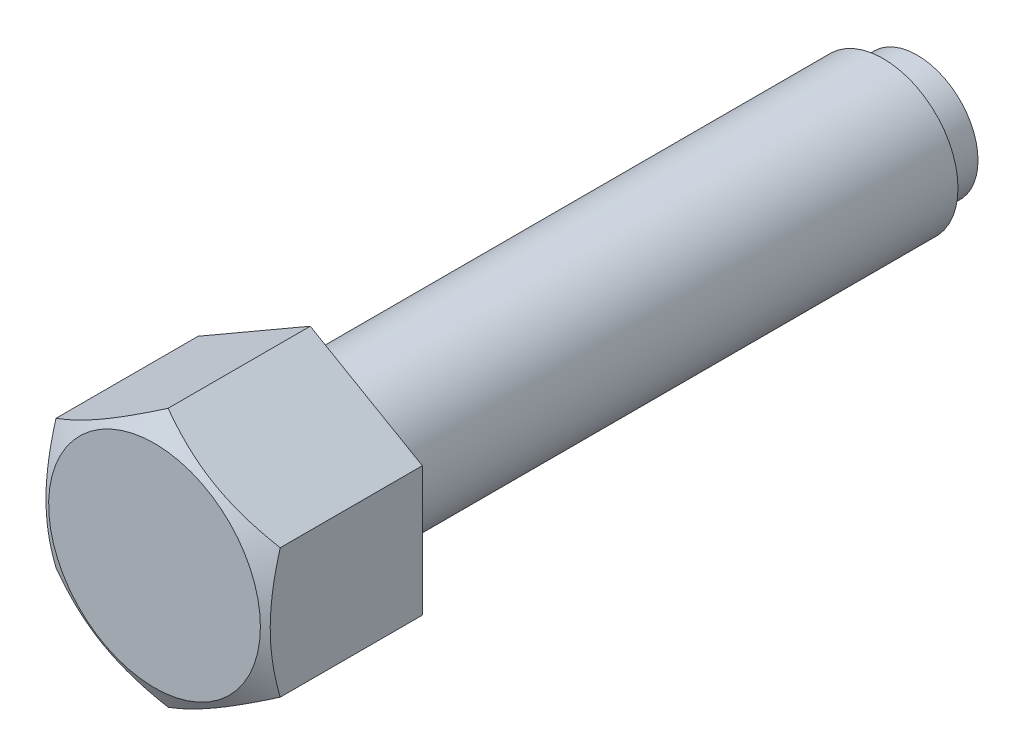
ISO-10303-21;
HEADER;
FILE_DESCRIPTION(('STEP AP214'),'2;1');
FILE_NAME('part.step','',(''),(''),'','','');
FILE_SCHEMA(('AUTOMOTIVE_DESIGN { 1 0 10303 214 1 1 1 1 }'));
ENDSEC;
DATA;
#1=APPLICATION_CONTEXT('core data for automotive mechanical design processes');
#2=APPLICATION_PROTOCOL_DEFINITION('international standard','automotive_design',2000,#1);
#3=PRODUCT_CONTEXT('',#1,'mechanical');
#4=PRODUCT('Part','Part','',(#3));
#5=PRODUCT_RELATED_PRODUCT_CATEGORY('part','',(#4));
#6=PRODUCT_DEFINITION_FORMATION('','',#4);
#7=PRODUCT_DEFINITION_CONTEXT('part definition',#1,'design');
#8=PRODUCT_DEFINITION('design','',#6,#7);
#9=PRODUCT_DEFINITION_SHAPE('','',#8);
#10=(LENGTH_UNIT() NAMED_UNIT(*) SI_UNIT(.MILLI.,.METRE.));
#11=(NAMED_UNIT(*) PLANE_ANGLE_UNIT() SI_UNIT($,.RADIAN.));
#12=(NAMED_UNIT(*) SI_UNIT($,.STERADIAN.) SOLID_ANGLE_UNIT());
#13=UNCERTAINTY_MEASURE_WITH_UNIT(LENGTH_MEASURE(1.E-05),#10,'distance_accuracy_value','');
#14=(GEOMETRIC_REPRESENTATION_CONTEXT(3) GLOBAL_UNCERTAINTY_ASSIGNED_CONTEXT((#13)) GLOBAL_UNIT_ASSIGNED_CONTEXT((#10,
#11,#12)) REPRESENTATION_CONTEXT('',''));
#15=CARTESIAN_POINT('',(0.,0.,0.));
#16=DIRECTION('',(0.,0.,1.));
#17=DIRECTION('',(1.,0.,0.));
#18=AXIS2_PLACEMENT_3D('',#15,#16,#17);
#19=CARTESIAN_POINT('',(0.,20.7846096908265,95.));
#20=DIRECTION('',(-0.5,-0.86602540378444,0.));
#21=DIRECTION('',(0.86602540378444,-0.5,0.));
#22=AXIS2_PLACEMENT_3D('',#19,#20,#21);
#23=PLANE('',#22);
#24=CARTESIAN_POINT('',(18.0002,10.3921893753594,122.814887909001));
#25=CARTESIAN_POINT('',(17.6045674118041,10.6206079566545,122.946756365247));
#26=CARTESIAN_POINT('',(17.2073916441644,10.8499174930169,123.072640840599));
#27=CARTESIAN_POINT('',(16.4098552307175,11.310375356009,123.310778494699));
#28=CARTESIAN_POINT('',(16.0094935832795,11.5415242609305,123.423027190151));
#29=CARTESIAN_POINT('',(15.2048116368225,12.0061075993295,123.632384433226));
#30=CARTESIAN_POINT('',(14.8004842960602,12.2395460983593,123.729457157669));
#31=CARTESIAN_POINT('',(13.9890201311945,12.7080451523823,123.906377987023));
#32=CARTESIAN_POINT('',(13.5818834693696,12.9431056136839,123.98622707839));
#33=CARTESIAN_POINT('',(12.7752328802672,13.4088255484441,124.125304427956));
#34=CARTESIAN_POINT('',(12.3757788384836,13.6394504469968,124.184993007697));
#35=CARTESIAN_POINT('',(11.5750403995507,14.1017570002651,124.285077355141));
#36=CARTESIAN_POINT('',(11.1737559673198,14.3334386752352,124.325472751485));
#37=CARTESIAN_POINT('',(10.370513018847,14.7971912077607,124.385950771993));
#38=CARTESIAN_POINT('',(9.96855587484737,15.0292612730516,124.406057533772));
#39=CARTESIAN_POINT('',(9.16427056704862,15.4936156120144,124.425525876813));
#40=CARTESIAN_POINT('',(8.76194241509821,15.7258998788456,124.424888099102));
#41=CARTESIAN_POINT('',(8.00978065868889,16.1601606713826,124.404316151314));
#42=CARTESIAN_POINT('',(7.65989346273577,16.3621681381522,124.38689054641));
#43=CARTESIAN_POINT('',(6.96095368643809,16.765701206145,124.336680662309));
#44=CARTESIAN_POINT('',(6.61190109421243,16.9672268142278,124.303896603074));
#45=CARTESIAN_POINT('',(5.91476277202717,17.3697198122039,124.223538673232));
#46=CARTESIAN_POINT('',(5.56667820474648,17.5706865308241,124.175951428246));
#47=CARTESIAN_POINT('',(4.87216610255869,17.9716632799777,124.066826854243));
#48=CARTESIAN_POINT('',(4.52573856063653,18.1716733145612,124.005289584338));
#49=CARTESIAN_POINT('',(3.47411308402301,18.7788295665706,123.798187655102));
#50=CARTESIAN_POINT('',(2.77196054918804,19.1842175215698,123.631972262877));
#51=CARTESIAN_POINT('',(1.37812528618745,19.9889486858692,123.254731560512));
#52=CARTESIAN_POINT('',(0.686424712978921,20.3883021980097,123.043794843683));
#53=CARTESIAN_POINT('',(-0.000199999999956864,20.7847251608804,122.814887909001));
#54=B_SPLINE_CURVE_WITH_KNOTS('',3,(#24,#25,#26,#27,#28,#29,#30,#31,#32,#33,#34,#35,#36,#37,#38,
#39,#40,#41,#42,#43,#44,#45,#46,#47,#48,#49,#50,#51,#52,#53),.UNSPECIFIED.,.F.,.F.,(4,2,2,2,2,2,
2,2,2,2,2,2,2,2,4),(0.,1.42650335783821,2.85347447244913,4.28376471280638,5.71397301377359,
7.10888071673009,8.50381526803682,9.89708828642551,11.2903182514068,12.5031974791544,
13.7160593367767,14.9300201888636,16.1439758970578,18.6253607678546,21.1018751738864),.UNSPECIFIED.);
#55=CARTESIAN_POINT('',(18.,10.3923048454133,122.814954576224));
#56=VERTEX_POINT('',#55);
#57=CARTESIAN_POINT('',(0.,20.7846096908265,122.814954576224));
#58=VERTEX_POINT('',#57);
#59=EDGE_CURVE('E30',#56,#58,#54,.T.);
#60=ORIENTED_EDGE('',*,*,#59,.F.);
#61=DIRECTION('',(0.,0.,1.));
#62=VECTOR('',#61,1.);
#63=CARTESIAN_POINT('',(18.,10.3923048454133,95.));
#64=LINE('',#63,#62);
#65=CARTESIAN_POINT('',(18.,10.3923048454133,100.));
#66=VERTEX_POINT('',#65);
#67=EDGE_CURVE('E97',#66,#56,#64,.T.);
#68=ORIENTED_EDGE('',*,*,#67,.F.);
#69=DIRECTION('',(0.86602540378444,-0.5,0.));
#70=VECTOR('',#69,1.);
#71=CARTESIAN_POINT('',(18.,10.3923048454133,100.));
#72=LINE('',#71,#70);
#73=CARTESIAN_POINT('',(0.,20.7846096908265,100.));
#74=VERTEX_POINT('',#73);
#75=EDGE_CURVE('E111',#74,#66,#72,.T.);
#76=ORIENTED_EDGE('',*,*,#75,.F.);
#77=DIRECTION('',(0.,0.,1.));
#78=VECTOR('',#77,1.);
#79=CARTESIAN_POINT('',(0.,20.7846096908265,95.));
#80=LINE('',#79,#78);
#81=EDGE_CURVE('E37',#74,#58,#80,.T.);
#82=ORIENTED_EDGE('',*,*,#81,.T.);
#83=EDGE_LOOP('',(#60,#68,#76,#82));
#84=FACE_BOUND('',#83,.T.);
#85=ADVANCED_FACE('F15',(#84),#23,.F.);
#86=CARTESIAN_POINT('',(18.,10.3923048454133,95.));
#87=DIRECTION('',(-1.,0.,0.));
#88=DIRECTION('',(0.,-1.,0.));
#89=AXIS2_PLACEMENT_3D('',#86,#87,#88);
#90=PLANE('',#89);
#91=CARTESIAN_POINT('',(18.,-27.8488467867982,115.670257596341));
#92=CARTESIAN_POINT('',(18.,-27.4560414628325,115.860718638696));
#93=CARTESIAN_POINT('',(18.,-27.0627733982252,116.050224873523));
#94=CARTESIAN_POINT('',(18.,-26.275215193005,116.42711134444));
#95=CARTESIAN_POINT('',(18.,-25.8809250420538,116.614491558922));
#96=CARTESIAN_POINT('',(18.,-24.6962706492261,117.173168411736));
#97=CARTESIAN_POINT('',(18.,-23.9042396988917,117.540944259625));
#98=CARTESIAN_POINT('',(18.,-22.3105132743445,118.266864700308));
#99=CARTESIAN_POINT('',(18.,-21.5087886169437,118.624945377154));
#100=CARTESIAN_POINT('',(18.,-19.898940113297,119.326369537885));
#101=CARTESIAN_POINT('',(18.,-19.0908165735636,119.669713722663));
#102=CARTESIAN_POINT('',(18.,-17.4410835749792,120.348376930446));
#103=CARTESIAN_POINT('',(18.,-16.5992255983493,120.68309500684));
#104=CARTESIAN_POINT('',(18.,-14.9056301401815,121.327039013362));
#105=CARTESIAN_POINT('',(18.,-14.0538915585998,121.636262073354));
#106=CARTESIAN_POINT('',(18.,-12.3408234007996,122.221045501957));
#107=CARTESIAN_POINT('',(18.,-11.4795174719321,122.496674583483));
#108=CARTESIAN_POINT('',(18.,-9.74446925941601,123.005397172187));
#109=CARTESIAN_POINT('',(18.,-8.87073100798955,123.238504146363));
#110=CARTESIAN_POINT('',(18.,-7.55305733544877,123.547171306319));
#111=CARTESIAN_POINT('',(18.,-7.11384633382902,123.643024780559));
#112=CARTESIAN_POINT('',(18.,-6.23243569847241,123.819917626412));
#113=CARTESIAN_POINT('',(18.,-5.79023612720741,123.900957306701));
#114=CARTESIAN_POINT('',(18.,-4.90316617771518,124.046786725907));
#115=CARTESIAN_POINT('',(18.,-4.45829588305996,124.111576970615));
#116=CARTESIAN_POINT('',(18.,-3.56633655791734,124.22361667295));
#117=CARTESIAN_POINT('',(18.,-3.11924752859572,124.270866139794));
#118=CARTESIAN_POINT('',(18.,-2.2293097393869,124.346292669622));
#119=CARTESIAN_POINT('',(18.,-1.78648144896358,124.374709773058));
#120=CARTESIAN_POINT('',(18.,-0.900021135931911,124.412796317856));
#121=CARTESIAN_POINT('',(18.,-0.456389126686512,124.422466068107));
#122=CARTESIAN_POINT('',(18.,0.430888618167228,124.422828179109));
#123=CARTESIAN_POINT('',(18.,0.874534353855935,124.413520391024));
#124=CARTESIAN_POINT('',(18.,1.76103997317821,124.37615322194));
#125=CARTESIAN_POINT('',(18.,2.20389982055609,124.348092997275));
#126=CARTESIAN_POINT('',(18.,3.27021347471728,124.258545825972));
#127=CARTESIAN_POINT('',(18.,3.89292400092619,124.188051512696));
#128=CARTESIAN_POINT('',(18.,5.13368373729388,124.013841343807));
#129=CARTESIAN_POINT('',(18.,5.75173229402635,123.910120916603));
#130=CARTESIAN_POINT('',(18.,6.98259150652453,123.673148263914));
#131=CARTESIAN_POINT('',(18.,7.59539765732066,123.539872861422));
#132=CARTESIAN_POINT('',(18.,8.81484353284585,123.247852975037));
#133=CARTESIAN_POINT('',(18.,9.42148335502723,123.089108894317));
#134=CARTESIAN_POINT('',(18.,10.6419538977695,122.746253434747));
#135=CARTESIAN_POINT('',(18.,11.2556482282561,122.561659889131));
#136=CARTESIAN_POINT('',(18.,12.4769902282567,122.173550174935));
#137=CARTESIAN_POINT('',(18.,13.0846378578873,121.970033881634));
#138=CARTESIAN_POINT('',(18.,14.2941900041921,121.547297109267));
#139=CARTESIAN_POINT('',(18.,14.8960963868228,121.32808194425));
#140=CARTESIAN_POINT('',(18.,16.0949308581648,120.876511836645));
#141=CARTESIAN_POINT('',(18.,16.6918590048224,120.644157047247));
#142=CARTESIAN_POINT('',(18.,18.0994905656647,120.081236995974));
#143=CARTESIAN_POINT('',(18.,18.9082876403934,119.74591194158));
#144=CARTESIAN_POINT('',(18.,20.5190326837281,119.059150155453));
#145=CARTESIAN_POINT('',(18.,21.3209802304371,118.707712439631));
#146=CARTESIAN_POINT('',(18.,22.919303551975,117.991953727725));
#147=CARTESIAN_POINT('',(18.,23.7156780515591,117.627629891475));
#148=CARTESIAN_POINT('',(18.,25.3036095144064,116.888699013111));
#149=CARTESIAN_POINT('',(18.,26.0951665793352,116.514092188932));
#150=CARTESIAN_POINT('',(18.,27.6751211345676,115.75610675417));
#151=CARTESIAN_POINT('',(18.,28.4635142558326,115.372719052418));
#152=CARTESIAN_POINT('',(18.,30.0369178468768,114.599065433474));
#153=CARTESIAN_POINT('',(18.,30.82192830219,114.208799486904));
#154=CARTESIAN_POINT('',(18.,32.3889887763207,113.422617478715));
#155=CARTESIAN_POINT('',(18.,33.1710391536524,113.026702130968));
#156=CARTESIAN_POINT('',(18.,34.7327014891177,112.230099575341));
#157=CARTESIAN_POINT('',(18.,35.5123134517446,111.829412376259));
#158=CARTESIAN_POINT('',(18.,37.7175837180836,110.688807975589));
#159=CARTESIAN_POINT('',(18.,39.1407964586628,109.944162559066));
#160=CARTESIAN_POINT('',(18.,41.9819614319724,108.444806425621));
#161=CARTESIAN_POINT('',(18.,43.3999134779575,107.690095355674));
#162=CARTESIAN_POINT('',(18.,46.2281945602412,106.174837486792));
#163=CARTESIAN_POINT('',(18.,47.6385337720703,105.41430966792));
#164=CARTESIAN_POINT('',(18.,49.7515613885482,104.269036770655));
#165=CARTESIAN_POINT('',(18.,50.4554715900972,103.886542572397));
#166=CARTESIAN_POINT('',(18.,51.8625585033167,103.120209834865));
#167=CARTESIAN_POINT('',(18.,52.5657352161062,102.736371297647));
#168=CARTESIAN_POINT('',(18.,53.268586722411,102.351938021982));
#169=B_SPLINE_CURVE_WITH_KNOTS('',3,(#91,#92,#93,#94,#95,#96,#97,#98,#99,#100,#101,#102,#103,
#104,#105,#106,#107,#108,#109,#110,#111,#112,#113,#114,#115,#116,#117,#118,#119,#120,#121,#122,
#123,#124,#125,#126,#127,#128,#129,#130,#131,#132,#133,#134,#135,#136,#137,#138,#139,#140,#141,
#142,#143,#144,#145,#146,#147,#148,#149,#150,#151,#152,#153,#154,#155,#156,#157,#158,#159,#160,
#161,#162,#163,#164,#165,#166,#167,#168),.UNSPECIFIED.,.F.,.F.,(4,2,2,2,2,2,2,2,2,2,2,2,2,2,2,2,
2,2,2,2,2,2,2,2,2,2,2,2,2,2,2,2,2,2,2,2,2,2,4),(0.,1.30963224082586,2.61927778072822,
5.23895990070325,7.87301555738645,10.5069457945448,13.2245064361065,15.9423725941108,
18.654582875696,21.3659326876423,22.714369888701,24.0627789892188,25.4111461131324,
26.759512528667,28.0903438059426,29.4211531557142,30.7519729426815,32.0828526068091,
33.9618754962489,35.8411570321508,37.7219175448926,39.6026482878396,41.5248491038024,
43.447062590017,45.368628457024,47.2901719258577,49.9165980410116,52.5431847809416,
55.1703540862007,57.7974677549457,60.427436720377,63.0574169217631,65.6870676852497,
68.3167136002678,73.1353953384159,77.9542465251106,82.7612146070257,85.1645700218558,
87.5679217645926),.UNSPECIFIED.);
#170=CARTESIAN_POINT('',(18.,-10.3923048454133,122.814954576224));
#171=VERTEX_POINT('',#170);
#172=EDGE_CURVE('E157',#171,#56,#169,.T.);
#173=ORIENTED_EDGE('',*,*,#172,.F.);
#174=DIRECTION('',(0.,0.,1.));
#175=VECTOR('',#174,1.);
#176=CARTESIAN_POINT('',(18.,-10.3923048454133,95.));
#177=LINE('',#176,#175);
#178=CARTESIAN_POINT('',(18.,-10.3923048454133,100.));
#179=VERTEX_POINT('',#178);
#180=EDGE_CURVE('E94',#179,#171,#177,.T.);
#181=ORIENTED_EDGE('',*,*,#180,.F.);
#182=DIRECTION('',(0.,-1.,0.));
#183=VECTOR('',#182,1.);
#184=CARTESIAN_POINT('',(18.,0.,100.));
#185=LINE('',#184,#183);
#186=EDGE_CURVE('E108',#66,#179,#185,.T.);
#187=ORIENTED_EDGE('',*,*,#186,.F.);
#188=ORIENTED_EDGE('',*,*,#67,.T.);
#189=EDGE_LOOP('',(#173,#181,#187,#188));
#190=FACE_BOUND('',#189,.T.);
#191=ADVANCED_FACE('F137',(#190),#90,.F.);
#192=CARTESIAN_POINT('',(0.,-20.7846096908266,95.));
#193=DIRECTION('',(0.5,-0.866025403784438,0.));
#194=DIRECTION('',(0.866025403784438,0.5,0.));
#195=AXIS2_PLACEMENT_3D('',#192,#193,#194);
#196=PLANE('',#195);
#197=ORIENTED_EDGE('',*,*,#180,.T.);
#198=CARTESIAN_POINT('',(18.0002,-10.3921893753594,122.814887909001));
#199=CARTESIAN_POINT('',(17.6045674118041,-10.6206079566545,122.946756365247));
#200=CARTESIAN_POINT('',(17.2073916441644,-10.8499174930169,123.072640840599));
#201=CARTESIAN_POINT('',(16.4098552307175,-11.310375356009,123.310778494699));
#202=CARTESIAN_POINT('',(16.0094935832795,-11.5415242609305,123.423027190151));
#203=CARTESIAN_POINT('',(15.2048116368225,-12.0061075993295,123.632384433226));
#204=CARTESIAN_POINT('',(14.8004842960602,-12.2395460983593,123.729457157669));
#205=CARTESIAN_POINT('',(13.9890201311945,-12.7080451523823,123.906377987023));
#206=CARTESIAN_POINT('',(13.5818834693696,-12.9431056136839,123.98622707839));
#207=CARTESIAN_POINT('',(12.7752328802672,-13.4088255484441,124.125304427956));
#208=CARTESIAN_POINT('',(12.3757788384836,-13.6394504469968,124.184993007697));
#209=CARTESIAN_POINT('',(11.5750403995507,-14.1017570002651,124.285077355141));
#210=CARTESIAN_POINT('',(11.1737559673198,-14.3334386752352,124.325472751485));
#211=CARTESIAN_POINT('',(10.370513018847,-14.7971912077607,124.385950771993));
#212=CARTESIAN_POINT('',(9.96855587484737,-15.0292612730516,124.406057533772));
#213=CARTESIAN_POINT('',(9.16427056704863,-15.4936156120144,124.425525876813));
#214=CARTESIAN_POINT('',(8.76194241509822,-15.7258998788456,124.424888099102));
#215=CARTESIAN_POINT('',(8.0097806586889,-16.1601606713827,124.404316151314));
#216=CARTESIAN_POINT('',(7.65989346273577,-16.3621681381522,124.38689054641));
#217=CARTESIAN_POINT('',(6.96095368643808,-16.765701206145,124.336680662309));
#218=CARTESIAN_POINT('',(6.61190109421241,-16.9672268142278,124.303896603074));
#219=CARTESIAN_POINT('',(5.91476277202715,-17.3697198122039,124.223538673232));
#220=CARTESIAN_POINT('',(5.56667820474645,-17.5706865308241,124.175951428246));
#221=CARTESIAN_POINT('',(4.87216610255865,-17.9716632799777,124.066826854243));
#222=CARTESIAN_POINT('',(4.52573856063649,-18.1716733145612,124.005289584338));
#223=CARTESIAN_POINT('',(3.47411308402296,-18.7788295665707,123.798187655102));
#224=CARTESIAN_POINT('',(2.77196054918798,-19.1842175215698,123.631972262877));
#225=CARTESIAN_POINT('',(1.37812528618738,-19.9889486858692,123.254731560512));
#226=CARTESIAN_POINT('',(0.686424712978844,-20.3883021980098,123.043794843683));
#227=CARTESIAN_POINT('',(-0.000200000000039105,-20.7847251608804,122.814887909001));
#228=B_SPLINE_CURVE_WITH_KNOTS('',3,(#198,#199,#200,#201,#202,#203,#204,#205,#206,#207,#208,
#209,#210,#211,#212,#213,#214,#215,#216,#217,#218,#219,#220,#221,#222,#223,#224,#225,#226,#227),
.UNSPECIFIED.,.F.,.F.,(4,2,2,2,2,2,2,2,2,2,2,2,2,2,4),(0.,1.42650335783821,2.85347447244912,
4.28376471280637,5.71397301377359,7.10888071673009,8.50381526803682,9.89708828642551,
11.2903182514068,12.5031974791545,13.7160593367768,14.9300201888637,16.1439758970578,
18.6253607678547,21.1018751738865),.UNSPECIFIED.);
#229=CARTESIAN_POINT('',(0.,-20.7846096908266,122.814954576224));
#230=VERTEX_POINT('',#229);
#231=EDGE_CURVE('E163',#171,#230,#228,.T.);
#232=ORIENTED_EDGE('',*,*,#231,.T.);
#233=DIRECTION('',(0.,0.,1.));
#234=VECTOR('',#233,1.);
#235=CARTESIAN_POINT('',(0.,-20.7846096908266,95.));
#236=LINE('',#235,#234);
#237=CARTESIAN_POINT('',(0.,-20.7846096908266,100.));
#238=VERTEX_POINT('',#237);
#239=EDGE_CURVE('E87',#238,#230,#236,.T.);
#240=ORIENTED_EDGE('',*,*,#239,.F.);
#241=DIRECTION('',(0.866025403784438,0.5,0.));
#242=VECTOR('',#241,1.);
#243=CARTESIAN_POINT('',(18.,-10.3923048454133,100.));
#244=LINE('',#243,#242);
#245=EDGE_CURVE('E106',#238,#179,#244,.T.);
#246=ORIENTED_EDGE('',*,*,#245,.T.);
#247=EDGE_LOOP('',(#197,#232,#240,#246));
#248=FACE_BOUND('',#247,.T.);
#249=ADVANCED_FACE('F143',(#248),#196,.T.);
#250=CARTESIAN_POINT('',(0.,-20.7846096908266,95.));
#251=DIRECTION('',(0.5,0.866025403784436,0.));
#252=DIRECTION('',(-0.866025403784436,0.5,0.));
#253=AXIS2_PLACEMENT_3D('',#250,#251,#252);
#254=PLANE('',#253);
#255=CARTESIAN_POINT('',(-18.0002,-10.3921893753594,122.814887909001));
#256=CARTESIAN_POINT('',(-17.6045674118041,-10.6206079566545,122.946756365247));
#257=CARTESIAN_POINT('',(-17.2073916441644,-10.8499174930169,123.072640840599));
#258=CARTESIAN_POINT('',(-16.4098552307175,-11.310375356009,123.310778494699));
#259=CARTESIAN_POINT('',(-16.0094935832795,-11.5415242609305,123.423027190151));
#260=CARTESIAN_POINT('',(-15.2048116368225,-12.0061075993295,123.632384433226));
#261=CARTESIAN_POINT('',(-14.8004842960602,-12.2395460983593,123.729457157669));
#262=CARTESIAN_POINT('',(-13.9890201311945,-12.7080451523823,123.906377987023));
#263=CARTESIAN_POINT('',(-13.5818834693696,-12.9431056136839,123.98622707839));
#264=CARTESIAN_POINT('',(-12.7752328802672,-13.4088255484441,124.125304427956));
#265=CARTESIAN_POINT('',(-12.3757788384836,-13.6394504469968,124.184993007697));
#266=CARTESIAN_POINT('',(-11.5750403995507,-14.1017570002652,124.285077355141));
#267=CARTESIAN_POINT('',(-11.1737559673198,-14.3334386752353,124.325472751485));
#268=CARTESIAN_POINT('',(-10.3705130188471,-14.7971912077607,124.385950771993));
#269=CARTESIAN_POINT('',(-9.96855587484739,-15.0292612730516,124.406057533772));
#270=CARTESIAN_POINT('',(-9.16427056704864,-15.4936156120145,124.425525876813));
#271=CARTESIAN_POINT('',(-8.76194241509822,-15.7258998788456,124.424888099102));
#272=CARTESIAN_POINT('',(-8.0097806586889,-16.1601606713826,124.404316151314));
#273=CARTESIAN_POINT('',(-7.65989346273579,-16.3621681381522,124.38689054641));
#274=CARTESIAN_POINT('',(-6.96095368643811,-16.765701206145,124.336680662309));
#275=CARTESIAN_POINT('',(-6.61190109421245,-16.9672268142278,124.303896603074));
#276=CARTESIAN_POINT('',(-5.91476277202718,-17.3697198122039,124.223538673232));
#277=CARTESIAN_POINT('',(-5.56667820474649,-17.5706865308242,124.175951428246));
#278=CARTESIAN_POINT('',(-4.8721661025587,-17.9716632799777,124.066826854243));
#279=CARTESIAN_POINT('',(-4.52573856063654,-18.1716733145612,124.005289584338));
#280=CARTESIAN_POINT('',(-3.47411308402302,-18.7788295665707,123.798187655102));
#281=CARTESIAN_POINT('',(-2.77196054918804,-19.1842175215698,123.631972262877));
#282=CARTESIAN_POINT('',(-1.37812528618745,-19.9889486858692,123.254731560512));
#283=CARTESIAN_POINT('',(-0.686424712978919,-20.3883021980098,123.043794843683));
#284=CARTESIAN_POINT('',(0.000199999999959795,-20.7847251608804,122.814887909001));
#285=B_SPLINE_CURVE_WITH_KNOTS('',3,(#255,#256,#257,#258,#259,#260,#261,#262,#263,#264,#265,
#266,#267,#268,#269,#270,#271,#272,#273,#274,#275,#276,#277,#278,#279,#280,#281,#282,#283,#284),
.UNSPECIFIED.,.F.,.F.,(4,2,2,2,2,2,2,2,2,2,2,2,2,2,4),(0.,1.42650335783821,2.85347447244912,
4.28376471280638,5.71397301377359,7.10888071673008,8.50381526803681,9.8970882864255,
11.2903182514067,12.5031974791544,13.7160593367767,14.9300201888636,16.1439758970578,
18.6253607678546,21.1018751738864),.UNSPECIFIED.);
#286=CARTESIAN_POINT('',(-18.,-10.3923048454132,122.814954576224));
#287=VERTEX_POINT('',#286);
#288=EDGE_CURVE('E81',#287,#230,#285,.T.);
#289=ORIENTED_EDGE('',*,*,#288,.F.);
#290=DIRECTION('',(0.,0.,1.));
#291=VECTOR('',#290,1.);
#292=CARTESIAN_POINT('',(-18.,-10.3923048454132,95.));
#293=LINE('',#292,#291);
#294=CARTESIAN_POINT('',(-18.,-10.3923048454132,100.));
#295=VERTEX_POINT('',#294);
#296=EDGE_CURVE('E80',#295,#287,#293,.T.);
#297=ORIENTED_EDGE('',*,*,#296,.F.);
#298=DIRECTION('',(-0.866025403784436,0.5,0.));
#299=VECTOR('',#298,1.);
#300=CARTESIAN_POINT('',(-1.3010426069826E-13,-20.7846096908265,100.));
#301=LINE('',#300,#299);
#302=EDGE_CURVE('E103',#238,#295,#301,.T.);
#303=ORIENTED_EDGE('',*,*,#302,.F.);
#304=ORIENTED_EDGE('',*,*,#239,.T.);
#305=EDGE_LOOP('',(#289,#297,#303,#304));
#306=FACE_BOUND('',#305,.T.);
#307=ADVANCED_FACE('F239',(#306),#254,.F.);
#308=CARTESIAN_POINT('',(-18.,10.3923048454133,95.));
#309=DIRECTION('',(-1.,0.,0.));
#310=DIRECTION('',(0.,0.,1.));
#311=AXIS2_PLACEMENT_3D('',#308,#309,#310);
#312=PLANE('',#311);
#313=ORIENTED_EDGE('',*,*,#296,.T.);
#314=CARTESIAN_POINT('',(-18.,-27.848846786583,115.670257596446));
#315=CARTESIAN_POINT('',(-18.,-27.4560414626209,115.860718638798));
#316=CARTESIAN_POINT('',(-18.,-27.0627733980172,116.050224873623));
#317=CARTESIAN_POINT('',(-18.,-26.2752151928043,116.427111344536));
#318=CARTESIAN_POINT('',(-18.,-25.8809250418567,116.614491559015));
#319=CARTESIAN_POINT('',(-18.,-24.6962706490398,117.173168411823));
#320=CARTESIAN_POINT('',(-18.,-23.9042396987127,117.540944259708));
#321=CARTESIAN_POINT('',(-18.,-22.3105132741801,118.266864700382));
#322=CARTESIAN_POINT('',(-18.,-21.5087886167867,118.624945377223));
#323=CARTESIAN_POINT('',(-18.,-19.8989401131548,119.326369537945));
#324=CARTESIAN_POINT('',(-18.,-19.0908165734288,119.66971372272));
#325=CARTESIAN_POINT('',(-18.,-17.4410835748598,120.348376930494));
#326=CARTESIAN_POINT('',(-18.,-16.5992255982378,120.683095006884));
#327=CARTESIAN_POINT('',(-18.,-14.9056301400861,121.327039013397));
#328=CARTESIAN_POINT('',(-18.,-14.0538915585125,121.636262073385));
#329=CARTESIAN_POINT('',(-18.,-12.3408234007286,122.22104550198));
#330=CARTESIAN_POINT('',(-18.,-11.4795174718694,122.496674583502));
#331=CARTESIAN_POINT('',(-18.,-9.74446925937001,123.0053971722));
#332=CARTESIAN_POINT('',(-18.,-8.87073100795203,123.238504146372));
#333=CARTESIAN_POINT('',(-18.,-7.55305733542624,123.547171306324));
#334=CARTESIAN_POINT('',(-18.,-7.11384633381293,123.643024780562));
#335=CARTESIAN_POINT('',(-18.,-6.2324356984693,123.819917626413));
#336=CARTESIAN_POINT('',(-18.,-5.79023612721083,123.9009573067));
#337=CARTESIAN_POINT('',(-18.,-4.90316617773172,124.046786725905));
#338=CARTESIAN_POINT('',(-18.,-4.45829588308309,124.111576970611));
#339=CARTESIAN_POINT('',(-18.,-3.56633655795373,124.223616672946));
#340=CARTESIAN_POINT('',(-18.,-3.11924752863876,124.27086613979));
#341=CARTESIAN_POINT('',(-18.,-2.22930973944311,124.346292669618));
#342=CARTESIAN_POINT('',(-18.,-1.78648144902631,124.374709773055));
#343=CARTESIAN_POINT('',(-18.,-0.900021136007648,124.412796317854));
#344=CARTESIAN_POINT('',(-18.,-0.456389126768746,124.422466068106));
#345=CARTESIAN_POINT('',(-18.,0.430888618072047,124.42282817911));
#346=CARTESIAN_POINT('',(-18.,0.874534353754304,124.413520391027));
#347=CARTESIAN_POINT('',(-18.,1.76103997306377,124.376153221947));
#348=CARTESIAN_POINT('',(-18.,2.20389982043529,124.348092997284));
#349=CARTESIAN_POINT('',(-18.,3.2702134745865,124.258545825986));
#350=CARTESIAN_POINT('',(-18.,3.8929240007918,124.188051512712));
#351=CARTESIAN_POINT('',(-18.,5.13368373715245,124.01384134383));
#352=CARTESIAN_POINT('',(-18.,5.75173229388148,123.910120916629));
#353=CARTESIAN_POINT('',(-18.,6.98259150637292,123.673148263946));
#354=CARTESIAN_POINT('',(-18.,7.59539765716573,123.539872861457));
#355=CARTESIAN_POINT('',(-18.,8.81484353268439,123.247852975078));
#356=CARTESIAN_POINT('',(-18.,9.42148335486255,123.089108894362));
#357=CARTESIAN_POINT('',(-18.,10.6419538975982,122.746253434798));
#358=CARTESIAN_POINT('',(-18.,11.2556482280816,122.561659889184));
#359=CARTESIAN_POINT('',(-18.,12.4769902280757,122.173550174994));
#360=CARTESIAN_POINT('',(-18.,13.084637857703,121.970033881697));
#361=CARTESIAN_POINT('',(-18.,14.2941900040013,121.547297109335));
#362=CARTESIAN_POINT('',(-18.,14.8960963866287,121.328081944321));
#363=CARTESIAN_POINT('',(-18.,16.0949308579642,120.876511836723));
#364=CARTESIAN_POINT('',(-18.,16.6918590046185,120.644157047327));
#365=CARTESIAN_POINT('',(-18.,18.0994905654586,120.081236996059));
#366=CARTESIAN_POINT('',(-18.,18.9082876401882,119.745911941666));
#367=CARTESIAN_POINT('',(-18.,20.5190326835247,119.059150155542));
#368=CARTESIAN_POINT('',(-18.,21.3209802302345,118.707712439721));
#369=CARTESIAN_POINT('',(-18.,22.919303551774,117.991953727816));
#370=CARTESIAN_POINT('',(-18.,23.7156780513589,117.627629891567));
#371=CARTESIAN_POINT('',(-18.,25.3036095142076,116.888699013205));
#372=CARTESIAN_POINT('',(-18.,26.0951665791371,116.514092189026));
#373=CARTESIAN_POINT('',(-18.,27.6751211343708,115.756106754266));
#374=CARTESIAN_POINT('',(-18.,28.4635142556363,115.372719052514));
#375=CARTESIAN_POINT('',(-18.,30.0369178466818,114.599065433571));
#376=CARTESIAN_POINT('',(-18.,30.8219283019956,114.208799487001));
#377=CARTESIAN_POINT('',(-18.,32.3889887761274,113.422617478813));
#378=CARTESIAN_POINT('',(-18.,33.1710391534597,113.026702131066));
#379=CARTESIAN_POINT('',(-18.,34.732701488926,112.230099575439));
#380=CARTESIAN_POINT('',(-18.,35.5123134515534,111.829412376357));
#381=CARTESIAN_POINT('',(-18.,37.7175837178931,110.688807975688));
#382=CARTESIAN_POINT('',(-18.,39.1407964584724,109.944162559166));
#383=CARTESIAN_POINT('',(-18.,41.9819614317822,108.444806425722));
#384=CARTESIAN_POINT('',(-18.,43.3999134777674,107.690095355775));
#385=CARTESIAN_POINT('',(-18.,46.2281945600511,106.174837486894));
#386=CARTESIAN_POINT('',(-18.,47.6385337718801,105.414309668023));
#387=CARTESIAN_POINT('',(-18.,49.7515613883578,104.269036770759));
#388=CARTESIAN_POINT('',(-18.,50.4554715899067,103.8865425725));
#389=CARTESIAN_POINT('',(-18.,51.8625585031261,103.120209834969));
#390=CARTESIAN_POINT('',(-18.,52.5657352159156,102.736371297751));
#391=CARTESIAN_POINT('',(-18.,53.2685867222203,102.351938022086));
#392=B_SPLINE_CURVE_WITH_KNOTS('',3,(#314,#315,#316,#317,#318,#319,#320,#321,#322,#323,#324,
#325,#326,#327,#328,#329,#330,#331,#332,#333,#334,#335,#336,#337,#338,#339,#340,#341,#342,#343,
#344,#345,#346,#347,#348,#349,#350,#351,#352,#353,#354,#355,#356,#357,#358,#359,#360,#361,#362,
#363,#364,#365,#366,#367,#368,#369,#370,#371,#372,#373,#374,#375,#376,#377,#378,#379,#380,#381,
#382,#383,#384,#385,#386,#387,#388,#389,#390,#391),.UNSPECIFIED.,.F.,.F.,(4,2,2,2,2,2,2,2,2,2,2,
2,2,2,2,2,2,2,2,2,2,2,2,2,2,2,2,2,2,2,2,2,2,2,2,2,2,2,4),(0.,1.30963224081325,2.61927778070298,
5.23895990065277,7.87301555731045,10.5069457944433,13.224506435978,15.9423725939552,
18.6545828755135,21.3659326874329,22.7143698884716,24.0627789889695,25.4111461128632,
26.759512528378,28.0903438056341,29.4211531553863,30.7519729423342,32.0828526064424,
33.9618754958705,35.8411570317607,37.7219175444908,39.6026482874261,41.5248491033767,
43.4470625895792,45.368628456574,47.2901719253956,49.9165980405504,52.5431847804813,
55.1703540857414,57.7974677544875,60.4274367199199,63.0574169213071,65.6870676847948,
68.316713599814,73.1353953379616,77.9542465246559,82.7612146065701,85.1645700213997,
87.567921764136),.UNSPECIFIED.);
#393=CARTESIAN_POINT('',(-18.,10.3923048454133,122.814954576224));
#394=VERTEX_POINT('',#393);
#395=EDGE_CURVE('E68',#287,#394,#392,.T.);
#396=ORIENTED_EDGE('',*,*,#395,.T.);
#397=DIRECTION('',(0.,0.,1.));
#398=VECTOR('',#397,1.);
#399=CARTESIAN_POINT('',(-18.,10.3923048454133,95.));
#400=LINE('',#399,#398);
#401=CARTESIAN_POINT('',(-18.,10.3923048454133,100.));
#402=VERTEX_POINT('',#401);
#403=EDGE_CURVE('E77',#402,#394,#400,.T.);
#404=ORIENTED_EDGE('',*,*,#403,.F.);
#405=DIRECTION('',(0.,-1.,0.));
#406=VECTOR('',#405,1.);
#407=CARTESIAN_POINT('',(-18.,0.,100.));
#408=LINE('',#407,#406);
#409=EDGE_CURVE('E101',#402,#295,#408,.T.);
#410=ORIENTED_EDGE('',*,*,#409,.T.);
#411=EDGE_LOOP('',(#313,#396,#404,#410));
#412=FACE_BOUND('',#411,.T.);
#413=ADVANCED_FACE('F76',(#412),#312,.T.);
#414=CARTESIAN_POINT('',(0.,20.7846096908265,95.));
#415=DIRECTION('',(-0.5,0.866025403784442,0.));
#416=DIRECTION('',(-0.866025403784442,-0.5,0.));
#417=AXIS2_PLACEMENT_3D('',#414,#415,#416);
#418=PLANE('',#417);
#419=ORIENTED_EDGE('',*,*,#403,.T.);
#420=CARTESIAN_POINT('',(-18.0002,10.3921893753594,122.814887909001));
#421=CARTESIAN_POINT('',(-17.6045674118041,10.6206079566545,122.946756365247));
#422=CARTESIAN_POINT('',(-17.2073916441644,10.8499174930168,123.072640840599));
#423=CARTESIAN_POINT('',(-16.4098552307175,11.310375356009,123.310778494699));
#424=CARTESIAN_POINT('',(-16.0094935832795,11.5415242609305,123.423027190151));
#425=CARTESIAN_POINT('',(-15.2048116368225,12.0061075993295,123.632384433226));
#426=CARTESIAN_POINT('',(-14.8004842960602,12.2395460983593,123.729457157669));
#427=CARTESIAN_POINT('',(-13.9890201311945,12.7080451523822,123.906377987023));
#428=CARTESIAN_POINT('',(-13.5818834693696,12.9431056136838,123.98622707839));
#429=CARTESIAN_POINT('',(-12.7752328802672,13.4088255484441,124.125304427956));
#430=CARTESIAN_POINT('',(-12.3757788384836,13.6394504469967,124.184993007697));
#431=CARTESIAN_POINT('',(-11.5750403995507,14.1017570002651,124.285077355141));
#432=CARTESIAN_POINT('',(-11.1737559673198,14.3334386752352,124.325472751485));
#433=CARTESIAN_POINT('',(-10.370513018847,14.7971912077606,124.385950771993));
#434=CARTESIAN_POINT('',(-9.96855587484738,15.0292612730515,124.406057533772));
#435=CARTESIAN_POINT('',(-9.16427056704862,15.4936156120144,124.425525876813));
#436=CARTESIAN_POINT('',(-8.76194241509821,15.7258998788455,124.424888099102));
#437=CARTESIAN_POINT('',(-8.00978065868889,16.1601606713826,124.404316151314));
#438=CARTESIAN_POINT('',(-7.65989346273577,16.3621681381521,124.38689054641));
#439=CARTESIAN_POINT('',(-6.96095368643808,16.7657012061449,124.336680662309));
#440=CARTESIAN_POINT('',(-6.61190109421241,16.9672268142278,124.303896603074));
#441=CARTESIAN_POINT('',(-5.91476277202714,17.3697198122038,124.223538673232));
#442=CARTESIAN_POINT('',(-5.56667820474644,17.5706865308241,124.175951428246));
#443=CARTESIAN_POINT('',(-4.87216610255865,17.9716632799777,124.066826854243));
#444=CARTESIAN_POINT('',(-4.52573856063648,18.1716733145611,124.005289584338));
#445=CARTESIAN_POINT('',(-3.47411308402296,18.7788295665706,123.798187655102));
#446=CARTESIAN_POINT('',(-2.77196054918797,19.1842175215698,123.631972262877));
#447=CARTESIAN_POINT('',(-1.37812528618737,19.9889486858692,123.254731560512));
#448=CARTESIAN_POINT('',(-0.686424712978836,20.3883021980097,123.043794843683));
#449=CARTESIAN_POINT('',(0.00020000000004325,20.7847251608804,122.814887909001));
#450=B_SPLINE_CURVE_WITH_KNOTS('',3,(#420,#421,#422,#423,#424,#425,#426,#427,#428,#429,#430,
#431,#432,#433,#434,#435,#436,#437,#438,#439,#440,#441,#442,#443,#444,#445,#446,#447,#448,#449),
.UNSPECIFIED.,.F.,.F.,(4,2,2,2,2,2,2,2,2,2,2,2,2,2,4),(0.,1.42650335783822,2.85347447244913,
4.28376471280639,5.71397301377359,7.10888071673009,8.50381526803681,9.89708828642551,
11.2903182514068,12.5031974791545,13.7160593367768,14.9300201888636,16.1439758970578,
18.6253607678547,21.1018751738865),.UNSPECIFIED.);
#451=EDGE_CURVE('E65',#394,#58,#450,.T.);
#452=ORIENTED_EDGE('',*,*,#451,.T.);
#453=ORIENTED_EDGE('',*,*,#81,.F.);
#454=DIRECTION('',(-0.866025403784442,-0.5,0.));
#455=VECTOR('',#454,1.);
#456=CARTESIAN_POINT('',(1.49186218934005E-13,20.7846096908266,100.));
#457=LINE('',#456,#455);
#458=EDGE_CURVE('E85',#74,#402,#457,.T.);
#459=ORIENTED_EDGE('',*,*,#458,.T.);
#460=EDGE_LOOP('',(#419,#452,#453,#459));
#461=FACE_BOUND('',#460,.T.);
#462=ADVANCED_FACE('F83',(#461),#418,.T.);
#463=CARTESIAN_POINT('',(0.,0.,20.));
#464=DIRECTION('',(0.,0.,1.));
#465=DIRECTION('',(1.,0.,0.));
#466=AXIS2_PLACEMENT_3D('',#463,#464,#465);
#467=SPHERICAL_SURFACE('',#466,20.);
#468=CARTESIAN_POINT('',(0.,0.,2.53754026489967));
#469=DIRECTION('',(0.,0.,1.));
#470=DIRECTION('',(1.,0.,0.));
#471=AXIS2_PLACEMENT_3D('',#468,#469,#470);
#472=CIRCLE('',#471,9.75);
#473=CARTESIAN_POINT('',(9.75,0.,2.53754026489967));
#474=VERTEX_POINT('',#473);
#475=EDGE_CURVE('E9',#474,#474,#472,.T.);
#476=ORIENTED_EDGE('',*,*,#475,.F.);
#477=EDGE_LOOP('',(#476));
#478=FACE_BOUND('',#477,.T.);
#479=ADVANCED_FACE('F17',(#478),#467,.T.);
#480=CARTESIAN_POINT('',(0.,0.,110.));
#481=DIRECTION('',(0.,0.,1.));
#482=DIRECTION('',(1.,0.,0.));
#483=AXIS2_PLACEMENT_3D('',#480,#481,#482);
#484=CYLINDRICAL_SURFACE('',#483,9.75);
#485=ORIENTED_EDGE('',*,*,#475,.T.);
#486=EDGE_LOOP('',(#485));
#487=FACE_BOUND('',#486,.T.);
#488=CARTESIAN_POINT('',(0.,0.,8.));
#489=DIRECTION('',(0.,0.,1.));
#490=DIRECTION('',(1.,0.,0.));
#491=AXIS2_PLACEMENT_3D('',#488,#489,#490);
#492=CIRCLE('',#491,9.75);
#493=CARTESIAN_POINT('',(9.75,0.,8.));
#494=VERTEX_POINT('',#493);
#495=EDGE_CURVE('E23',#494,#494,#492,.T.);
#496=ORIENTED_EDGE('',*,*,#495,.F.);
#497=EDGE_LOOP('',(#496));
#498=FACE_BOUND('',#497,.T.);
#499=ADVANCED_FACE('F124',(#487,#498),#484,.T.);
#500=CARTESIAN_POINT('',(9.75,0.,8.));
#501=DIRECTION('',(0.,0.,1.));
#502=DIRECTION('',(1.,0.,0.));
#503=AXIS2_PLACEMENT_3D('',#500,#501,#502);
#504=PLANE('',#503);
#505=CARTESIAN_POINT('',(0.,0.,8.));
#506=DIRECTION('',(0.,0.,1.));
#507=DIRECTION('',(1.,0.,0.));
#508=AXIS2_PLACEMENT_3D('',#505,#506,#507);
#509=CIRCLE('',#508,12.);
#510=CARTESIAN_POINT('',(12.,0.,8.));
#511=VERTEX_POINT('',#510);
#512=EDGE_CURVE('E117',#511,#511,#509,.T.);
#513=ORIENTED_EDGE('',*,*,#512,.F.);
#514=EDGE_LOOP('',(#513));
#515=FACE_BOUND('',#514,.T.);
#516=ORIENTED_EDGE('',*,*,#495,.T.);
#517=EDGE_LOOP('',(#516));
#518=FACE_BOUND('',#517,.T.);
#519=ADVANCED_FACE('F122',(#515,#518),#504,.F.);
#520=CARTESIAN_POINT('',(0.,0.,110.));
#521=DIRECTION('',(0.,0.,1.));
#522=DIRECTION('',(1.,0.,0.));
#523=AXIS2_PLACEMENT_3D('',#520,#521,#522);
#524=CYLINDRICAL_SURFACE('',#523,12.);
#525=CARTESIAN_POINT('',(0.,0.,100.));
#526=DIRECTION('',(0.,0.,1.));
#527=DIRECTION('',(1.,0.,0.));
#528=AXIS2_PLACEMENT_3D('',#525,#526,#527);
#529=CIRCLE('',#528,12.);
#530=CARTESIAN_POINT('',(12.,0.,100.));
#531=VERTEX_POINT('',#530);
#532=EDGE_CURVE('E114',#531,#531,#529,.T.);
#533=ORIENTED_EDGE('',*,*,#532,.F.);
#534=EDGE_LOOP('',(#533));
#535=FACE_BOUND('',#534,.T.);
#536=ORIENTED_EDGE('',*,*,#512,.T.);
#537=EDGE_LOOP('',(#536));
#538=FACE_BOUND('',#537,.T.);
#539=ADVANCED_FACE('F132',(#535,#538),#524,.T.);
#540=CARTESIAN_POINT('',(12.,0.,100.));
#541=DIRECTION('',(0.,0.,1.));
#542=DIRECTION('',(1.,0.,0.));
#543=AXIS2_PLACEMENT_3D('',#540,#541,#542);
#544=PLANE('',#543);
#545=ORIENTED_EDGE('',*,*,#458,.F.);
#546=ORIENTED_EDGE('',*,*,#75,.T.);
#547=ORIENTED_EDGE('',*,*,#186,.T.);
#548=ORIENTED_EDGE('',*,*,#245,.F.);
#549=ORIENTED_EDGE('',*,*,#302,.T.);
#550=ORIENTED_EDGE('',*,*,#409,.F.);
#551=EDGE_LOOP('',(#545,#546,#547,#548,#549,#550));
#552=FACE_BOUND('',#551,.T.);
#553=ORIENTED_EDGE('',*,*,#532,.T.);
#554=EDGE_LOOP('',(#553));
#555=FACE_BOUND('',#554,.T.);
#556=ADVANCED_FACE('F178',(#552,#555),#544,.F.);
#557=CARTESIAN_POINT('',(0.,0.,125.));
#558=DIRECTION('',(0.,0.,-1.));
#559=DIRECTION('',(-1.,0.,0.));
#560=AXIS2_PLACEMENT_3D('',#557,#558,#559);
#561=CONICAL_SURFACE('',#560,17.,1.0471975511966);
#562=CARTESIAN_POINT('',(0.,0.,125.));
#563=DIRECTION('',(0.,0.,1.));
#564=DIRECTION('',(1.,0.,0.));
#565=AXIS2_PLACEMENT_3D('',#562,#563,#564);
#566=CIRCLE('',#565,17.);
#567=CARTESIAN_POINT('',(17.,0.,125.));
#568=VERTEX_POINT('',#567);
#569=EDGE_CURVE('E71',#568,#568,#566,.T.);
#570=ORIENTED_EDGE('',*,*,#569,.F.);
#571=EDGE_LOOP('',(#570));
#572=FACE_BOUND('',#571,.T.);
#573=ORIENTED_EDGE('',*,*,#59,.T.);
#574=ORIENTED_EDGE('',*,*,#451,.F.);
#575=ORIENTED_EDGE('',*,*,#395,.F.);
#576=ORIENTED_EDGE('',*,*,#288,.T.);
#577=ORIENTED_EDGE('',*,*,#231,.F.);
#578=ORIENTED_EDGE('',*,*,#172,.T.);
#579=EDGE_LOOP('',(#573,#574,#575,#576,#577,#578));
#580=FACE_BOUND('',#579,.T.);
#581=ADVANCED_FACE('F67',(#572,#580),#561,.T.);
#582=CARTESIAN_POINT('',(0.,0.,125.));
#583=DIRECTION('',(0.,0.,1.));
#584=DIRECTION('',(1.,0.,0.));
#585=AXIS2_PLACEMENT_3D('',#582,#583,#584);
#586=PLANE('',#585);
#587=ORIENTED_EDGE('',*,*,#569,.T.);
#588=EDGE_LOOP('',(#587));
#589=FACE_BOUND('',#588,.T.);
#590=ADVANCED_FACE('F174',(#589),#586,.T.);
#591=CLOSED_SHELL('',(#85,#191,#249,#307,#413,#462,#479,#499,#519,#539,#556,#581,#590));
#592=MANIFOLD_SOLID_BREP('B1',#591);
#593=ADVANCED_BREP_SHAPE_REPRESENTATION('',(#18,#592),#14);
#594=SHAPE_DEFINITION_REPRESENTATION(#9,#593);
ENDSEC;
END-ISO-10303-21;
